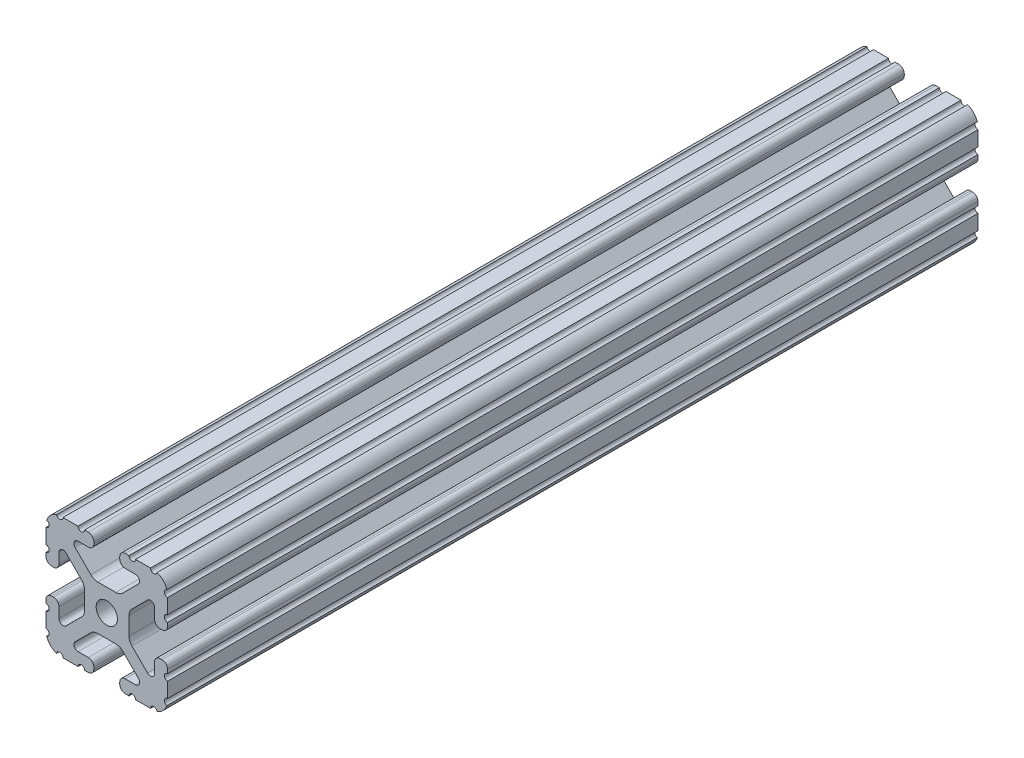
from build123d import *

# Parameters (mm, degrees)
BOSS_EXTRUDE1_DEPTH     = 457.2
CUT_EXTRUDE1_DEPTH      = 458.993062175
CUT_EXTRUDE1_DEPTH_BACK = 458.993062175
SKETCH5_R               = 1.016
SKETCH6_W               = 39.134581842
SKETCH6_H               = 38.977379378
CUT_EXTRUDE2_DEPTH      = 660.4


with BuildPart() as part:
    # Sketch4 → Boss-Extrude1 (new, symmetric)
    with BuildSketch(Plane.XY):
        with BuildLine():
            Line((5.7912, -19.05), (14.3002, -19.05))
            ThreePointArc((14.3002, -19.05), (17.658815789, -17.658815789), (19.05, -14.3002))
            Line((19.05, -14.3002), (19.05, -5.7912))
            ThreePointArc((19.05, -5.7912), (18.544114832, -4.569885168), (17.3228, -4.064))
            Line((17.3228, -4.064), (16.7132, -4.064))
            ThreePointArc((16.7132, -4.064), (15.491885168, -4.569885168), (14.986, -5.7912))
            Line((14.986, -5.7912), (14.986, -8.996305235))
            ThreePointArc((14.986, -8.996305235), (14.189232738, -10.188751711), (12.782646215, -9.908964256))
            Line((12.782646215, -9.908964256), (7.888897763, -5.015215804))
            ThreePointArc((7.888897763, -5.015215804), (7.219915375, -4.014012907), (6.985, -2.833013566))
            Line((6.985, -2.833013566), (6.985, 0))
            Line((6.985, 0), (3.3274, 0))
            ThreePointArc((3.3274, 0), (2.352827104, -2.352827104), (0, -3.3274))
            Line((0, -3.3274), (0, -6.985))
            Line((0, -6.985), (2.833013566, -6.985))
            ThreePointArc((2.833013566, -6.985), (4.014012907, -7.219915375), (5.015215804, -7.888897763))
            Line((5.015215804, -7.888897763), (9.908964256, -12.782646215))
            ThreePointArc((9.908964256, -12.782646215), (10.188751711, -14.189232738), (8.996305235, -14.986))
            Line((8.996305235, -14.986), (5.7912, -14.986))
            ThreePointArc((5.7912, -14.986), (4.569885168, -15.491885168), (4.064, -16.7132))
            Line((4.064, -16.7132), (4.064, -17.3228))
            ThreePointArc((4.064, -17.3228), (4.569885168, -18.544114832), (5.7912, -19.05))
        make_face()
    extrude(amount=BOSS_EXTRUDE1_DEPTH, both=True)

    # Sketch5 → Cut-Extrude1 (cut, two sides: drawn at the far end of the back side and taken through both)
    with BuildSketch(Plane.XY.offset(-CUT_EXTRUDE1_DEPTH_BACK)):
        with Locations((14.739477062, -19.05)):
            Circle(SKETCH5_R)
        with Locations((7.980305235, -19.05)):
            Circle(SKETCH5_R)
        with Locations((19.05, -14.739477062)):
            Circle(SKETCH5_R)
        with Locations((19.05, -7.980305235)):
            Circle(SKETCH5_R)
    extrude(amount=CUT_EXTRUDE1_DEPTH + CUT_EXTRUDE1_DEPTH_BACK, mode=Mode.SUBTRACT)

    # Mirror1: part across plane


with BuildPart() as part_1:
    add(part.part)
    add(part.part.mirror(Plane(origin=(0, 0, 0), x_dir=(0, 0, 1), z_dir=(1, 0, 0))))

    # Mirror2: part across plane


with BuildPart() as part_2:
    add(part_1.part)
    add(part_1.part.mirror(Plane.ZX))

    # Sketch6 → Cut-Extrude2 (cut)
    with BuildSketch(Plane.XY.offset(457.2)):
        Rectangle(SKETCH6_W, SKETCH6_H)
    extrude(amount=-CUT_EXTRUDE2_DEPTH, mode=Mode.SUBTRACT)


solid = part_2.part
